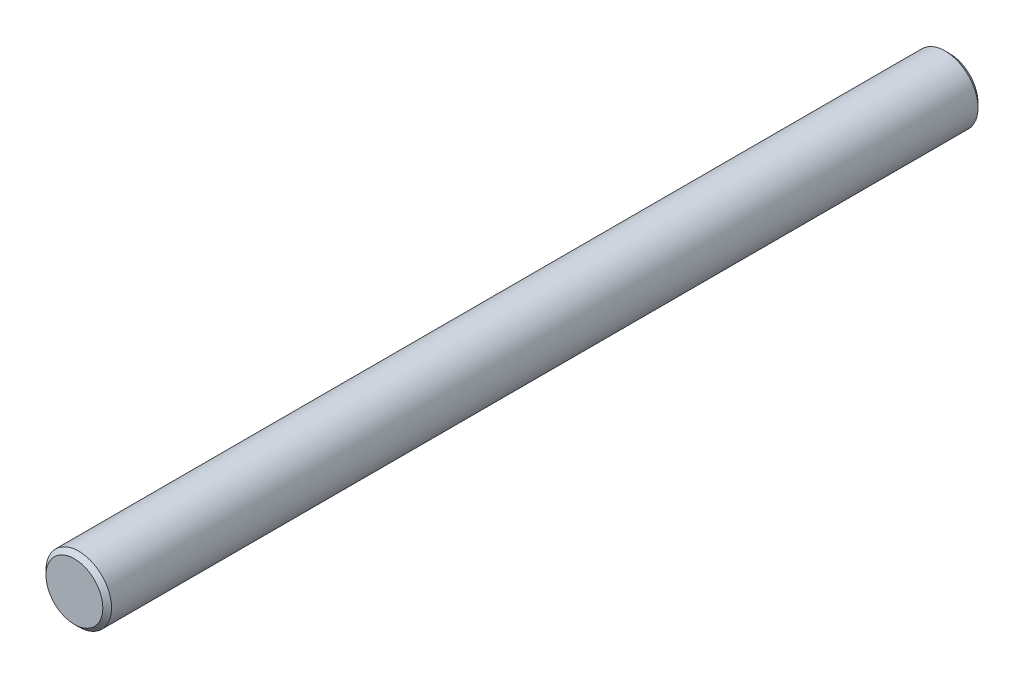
from build123d import *

# Parameters (mm, degrees)
ESQUISSE1_R      = 1.5
EXTRUSION1_DEPTH = 40
CHANFREIN1_SIZE  = 0.2


with BuildPart() as part:
    # Esquisse1 → Extrusion1 (new body)
    with BuildSketch(Plane.XY):
        Circle(ESQUISSE1_R)
    extrude(amount=EXTRUSION1_DEPTH)

    # Chanfrein1
    chanfrein1_edges = [part.edges().sort_by_distance(p)[0] for p in [
        (-1.5, 0, 0),
        (-1.5, 0, 40),
    ]]
    chamfer(chanfrein1_edges, length=CHANFREIN1_SIZE)


solid = part.part
